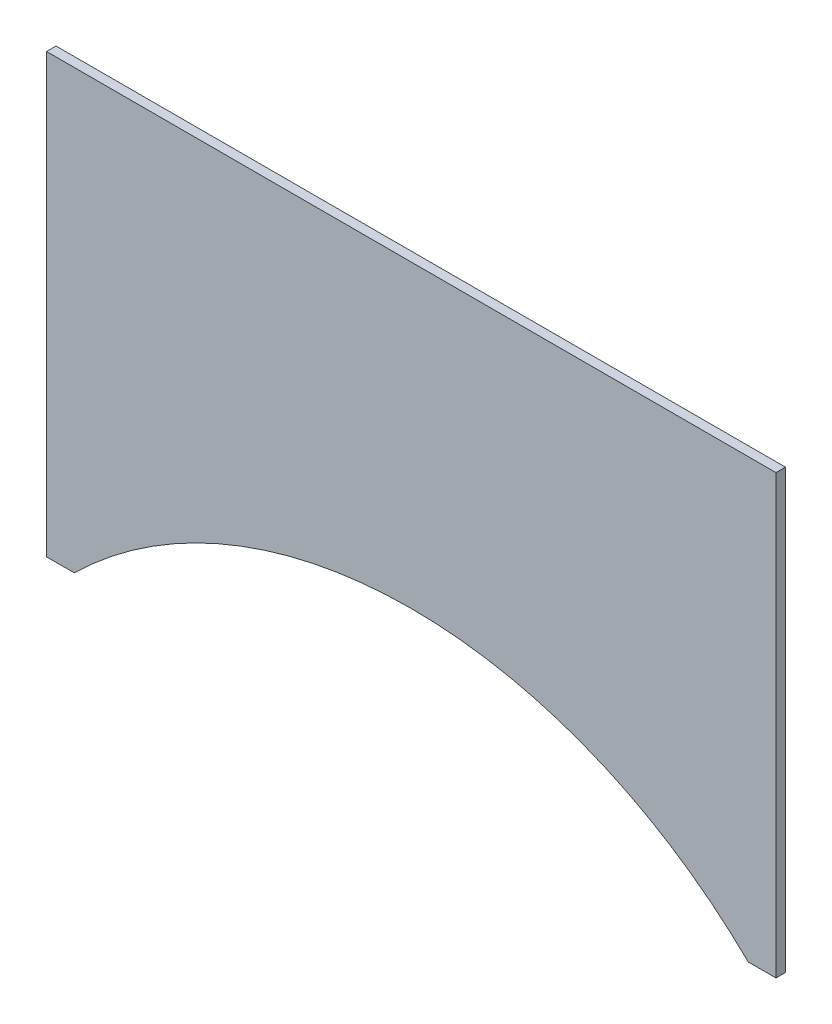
ISO-10303-21;
HEADER;
FILE_DESCRIPTION(('STEP AP214'),'2;1');
FILE_NAME('part.step','',(''),(''),'','','');
FILE_SCHEMA(('AUTOMOTIVE_DESIGN { 1 0 10303 214 1 1 1 1 }'));
ENDSEC;
DATA;
#1=APPLICATION_CONTEXT('core data for automotive mechanical design processes');
#2=APPLICATION_PROTOCOL_DEFINITION('international standard','automotive_design',2000,#1);
#3=PRODUCT_CONTEXT('',#1,'mechanical');
#4=PRODUCT('Part','Part','',(#3));
#5=PRODUCT_RELATED_PRODUCT_CATEGORY('part','',(#4));
#6=PRODUCT_DEFINITION_FORMATION('','',#4);
#7=PRODUCT_DEFINITION_CONTEXT('part definition',#1,'design');
#8=PRODUCT_DEFINITION('design','',#6,#7);
#9=PRODUCT_DEFINITION_SHAPE('','',#8);
#10=(LENGTH_UNIT() NAMED_UNIT(*) SI_UNIT(.MILLI.,.METRE.));
#11=(NAMED_UNIT(*) PLANE_ANGLE_UNIT() SI_UNIT($,.RADIAN.));
#12=(NAMED_UNIT(*) SI_UNIT($,.STERADIAN.) SOLID_ANGLE_UNIT());
#13=UNCERTAINTY_MEASURE_WITH_UNIT(LENGTH_MEASURE(1.E-05),#10,'distance_accuracy_value','');
#14=(GEOMETRIC_REPRESENTATION_CONTEXT(3) GLOBAL_UNCERTAINTY_ASSIGNED_CONTEXT((#13)) GLOBAL_UNIT_ASSIGNED_CONTEXT((#10,
#11,#12)) REPRESENTATION_CONTEXT('',''));
#15=CARTESIAN_POINT('',(0.,0.,0.));
#16=DIRECTION('',(0.,0.,1.));
#17=DIRECTION('',(1.,0.,0.));
#18=AXIS2_PLACEMENT_3D('',#15,#16,#17);
#19=CARTESIAN_POINT('',(-484.223432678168,-431.698113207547,13.));
#20=DIRECTION('',(1.,0.,0.));
#21=DIRECTION('',(0.,0.,-1.));
#22=AXIS2_PLACEMENT_3D('',#19,#20,#21);
#23=PLANE('',#22);
#24=DIRECTION('',(0.,-1.,0.));
#25=VECTOR('',#24,1.);
#26=CARTESIAN_POINT('',(-484.223432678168,-431.698113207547,0.));
#27=LINE('',#26,#25);
#28=CARTESIAN_POINT('',(-484.223432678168,168.301886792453,0.));
#29=VERTEX_POINT('',#28);
#30=CARTESIAN_POINT('',(-484.223432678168,-431.698113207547,0.));
#31=VERTEX_POINT('',#30);
#32=EDGE_CURVE('E117',#29,#31,#27,.T.);
#33=ORIENTED_EDGE('',*,*,#32,.T.);
#34=DIRECTION('',(0.,0.,-1.));
#35=VECTOR('',#34,1.);
#36=CARTESIAN_POINT('',(-484.223432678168,-431.698113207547,13.));
#37=LINE('',#36,#35);
#38=CARTESIAN_POINT('',(-484.223432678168,-431.698113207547,13.));
#39=VERTEX_POINT('',#38);
#40=EDGE_CURVE('E11',#39,#31,#37,.T.);
#41=ORIENTED_EDGE('',*,*,#40,.F.);
#42=DIRECTION('',(0.,-1.,0.));
#43=VECTOR('',#42,1.);
#44=CARTESIAN_POINT('',(-484.223432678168,-431.698113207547,13.));
#45=LINE('',#44,#43);
#46=CARTESIAN_POINT('',(-484.223432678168,168.301886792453,13.));
#47=VERTEX_POINT('',#46);
#48=EDGE_CURVE('E127',#47,#39,#45,.T.);
#49=ORIENTED_EDGE('',*,*,#48,.F.);
#50=DIRECTION('',(0.,0.,-1.));
#51=VECTOR('',#50,1.);
#52=CARTESIAN_POINT('',(-484.223432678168,168.301886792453,13.));
#53=LINE('',#52,#51);
#54=EDGE_CURVE('E113',#47,#29,#53,.T.);
#55=ORIENTED_EDGE('',*,*,#54,.T.);
#56=EDGE_LOOP('',(#33,#41,#49,#55));
#57=FACE_BOUND('',#56,.T.);
#58=ADVANCED_FACE('F33',(#57),#23,.F.);
#59=CARTESIAN_POINT('',(-484.223432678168,-431.698113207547,13.));
#60=DIRECTION('',(0.,1.,0.));
#61=DIRECTION('',(0.,0.,1.));
#62=AXIS2_PLACEMENT_3D('',#59,#60,#61);
#63=PLANE('',#62);
#64=DIRECTION('',(1.,0.,0.));
#65=VECTOR('',#64,1.);
#66=CARTESIAN_POINT('',(-484.223432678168,-431.698113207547,0.));
#67=LINE('',#66,#65);
#68=CARTESIAN_POINT('',(-446.223432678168,-431.698113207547,0.));
#69=VERTEX_POINT('',#68);
#70=EDGE_CURVE('E120',#31,#69,#67,.T.);
#71=ORIENTED_EDGE('',*,*,#70,.T.);
#72=DIRECTION('',(0.,0.,-1.));
#73=VECTOR('',#72,1.);
#74=CARTESIAN_POINT('',(-446.223432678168,-431.698113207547,13.));
#75=LINE('',#74,#73);
#76=CARTESIAN_POINT('',(-446.223432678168,-431.698113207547,13.));
#77=VERTEX_POINT('',#76);
#78=EDGE_CURVE('E41',#77,#69,#75,.T.);
#79=ORIENTED_EDGE('',*,*,#78,.F.);
#80=DIRECTION('',(1.,0.,0.));
#81=VECTOR('',#80,1.);
#82=CARTESIAN_POINT('',(-484.223432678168,-431.698113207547,13.));
#83=LINE('',#82,#81);
#84=EDGE_CURVE('E86',#39,#77,#83,.T.);
#85=ORIENTED_EDGE('',*,*,#84,.F.);
#86=ORIENTED_EDGE('',*,*,#40,.T.);
#87=EDGE_LOOP('',(#71,#79,#85,#86));
#88=FACE_BOUND('',#87,.T.);
#89=ADVANCED_FACE('F151',(#88),#63,.F.);
#90=CARTESIAN_POINT('',(15.7765673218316,-903.032389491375,13.));
#91=DIRECTION('',(0.,0.,-1.));
#92=DIRECTION('',(-1.,0.,0.));
#93=AXIS2_PLACEMENT_3D('',#90,#91,#92);
#94=CYLINDRICAL_SURFACE('',#93,660.);
#95=CARTESIAN_POINT('',(15.7765673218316,-903.032389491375,0.));
#96=DIRECTION('',(0.,0.,-1.));
#97=DIRECTION('',(-1.,0.,0.));
#98=AXIS2_PLACEMENT_3D('',#95,#96,#97);
#99=CIRCLE('',#98,660.);
#100=CARTESIAN_POINT('',(477.776567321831,-431.698113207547,0.));
#101=VERTEX_POINT('',#100);
#102=EDGE_CURVE('E122',#69,#101,#99,.T.);
#103=ORIENTED_EDGE('',*,*,#102,.T.);
#104=DIRECTION('',(0.,0.,-1.));
#105=VECTOR('',#104,1.);
#106=CARTESIAN_POINT('',(477.776567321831,-431.698113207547,13.));
#107=LINE('',#106,#105);
#108=CARTESIAN_POINT('',(477.776567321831,-431.698113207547,13.));
#109=VERTEX_POINT('',#108);
#110=EDGE_CURVE('E108',#109,#101,#107,.T.);
#111=ORIENTED_EDGE('',*,*,#110,.F.);
#112=CARTESIAN_POINT('',(15.7765673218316,-903.032389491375,13.));
#113=DIRECTION('',(0.,0.,-1.));
#114=DIRECTION('',(-1.,0.,0.));
#115=AXIS2_PLACEMENT_3D('',#112,#113,#114);
#116=CIRCLE('',#115,660.);
#117=EDGE_CURVE('E99',#77,#109,#116,.T.);
#118=ORIENTED_EDGE('',*,*,#117,.F.);
#119=ORIENTED_EDGE('',*,*,#78,.T.);
#120=EDGE_LOOP('',(#103,#111,#118,#119));
#121=FACE_BOUND('',#120,.T.);
#122=ADVANCED_FACE('F133',(#121),#94,.F.);
#123=CARTESIAN_POINT('',(515.776567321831,-431.698113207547,13.));
#124=DIRECTION('',(0.,1.,0.));
#125=DIRECTION('',(0.,0.,1.));
#126=AXIS2_PLACEMENT_3D('',#123,#124,#125);
#127=PLANE('',#126);
#128=DIRECTION('',(1.,0.,0.));
#129=VECTOR('',#128,1.);
#130=CARTESIAN_POINT('',(515.776567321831,-431.698113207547,0.));
#131=LINE('',#130,#129);
#132=CARTESIAN_POINT('',(515.776567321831,-431.698113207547,0.));
#133=VERTEX_POINT('',#132);
#134=EDGE_CURVE('E107',#101,#133,#131,.T.);
#135=ORIENTED_EDGE('',*,*,#134,.T.);
#136=DIRECTION('',(0.,0.,-1.));
#137=VECTOR('',#136,1.);
#138=CARTESIAN_POINT('',(515.776567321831,-431.698113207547,13.));
#139=LINE('',#138,#137);
#140=CARTESIAN_POINT('',(515.776567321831,-431.698113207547,13.));
#141=VERTEX_POINT('',#140);
#142=EDGE_CURVE('E104',#141,#133,#139,.T.);
#143=ORIENTED_EDGE('',*,*,#142,.F.);
#144=DIRECTION('',(1.,0.,0.));
#145=VECTOR('',#144,1.);
#146=CARTESIAN_POINT('',(515.776567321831,-431.698113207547,13.));
#147=LINE('',#146,#145);
#148=EDGE_CURVE('E93',#109,#141,#147,.T.);
#149=ORIENTED_EDGE('',*,*,#148,.F.);
#150=ORIENTED_EDGE('',*,*,#110,.T.);
#151=EDGE_LOOP('',(#135,#143,#149,#150));
#152=FACE_BOUND('',#151,.T.);
#153=ADVANCED_FACE('F105',(#152),#127,.F.);
#154=CARTESIAN_POINT('',(515.776567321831,168.301886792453,13.));
#155=DIRECTION('',(-1.,0.,0.));
#156=DIRECTION('',(0.,0.,1.));
#157=AXIS2_PLACEMENT_3D('',#154,#155,#156);
#158=PLANE('',#157);
#159=DIRECTION('',(0.,1.,0.));
#160=VECTOR('',#159,1.);
#161=CARTESIAN_POINT('',(515.776567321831,168.301886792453,0.));
#162=LINE('',#161,#160);
#163=CARTESIAN_POINT('',(515.776567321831,168.301886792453,0.));
#164=VERTEX_POINT('',#163);
#165=EDGE_CURVE('E72',#133,#164,#162,.T.);
#166=ORIENTED_EDGE('',*,*,#165,.T.);
#167=DIRECTION('',(0.,0.,-1.));
#168=VECTOR('',#167,1.);
#169=CARTESIAN_POINT('',(515.776567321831,168.301886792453,13.));
#170=LINE('',#169,#168);
#171=CARTESIAN_POINT('',(515.776567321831,168.301886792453,13.));
#172=VERTEX_POINT('',#171);
#173=EDGE_CURVE('E109',#172,#164,#170,.T.);
#174=ORIENTED_EDGE('',*,*,#173,.F.);
#175=DIRECTION('',(0.,1.,0.));
#176=VECTOR('',#175,1.);
#177=CARTESIAN_POINT('',(515.776567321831,168.301886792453,13.));
#178=LINE('',#177,#176);
#179=EDGE_CURVE('E97',#141,#172,#178,.T.);
#180=ORIENTED_EDGE('',*,*,#179,.F.);
#181=ORIENTED_EDGE('',*,*,#142,.T.);
#182=EDGE_LOOP('',(#166,#174,#180,#181));
#183=FACE_BOUND('',#182,.T.);
#184=ADVANCED_FACE('F111',(#183),#158,.F.);
#185=CARTESIAN_POINT('',(-484.223432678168,168.301886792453,13.));
#186=DIRECTION('',(0.,-1.,0.));
#187=DIRECTION('',(0.,0.,-1.));
#188=AXIS2_PLACEMENT_3D('',#185,#186,#187);
#189=PLANE('',#188);
#190=DIRECTION('',(-1.,0.,0.));
#191=VECTOR('',#190,1.);
#192=CARTESIAN_POINT('',(-484.223432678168,168.301886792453,0.));
#193=LINE('',#192,#191);
#194=EDGE_CURVE('E78',#164,#29,#193,.T.);
#195=ORIENTED_EDGE('',*,*,#194,.T.);
#196=ORIENTED_EDGE('',*,*,#54,.F.);
#197=DIRECTION('',(-1.,0.,0.));
#198=VECTOR('',#197,1.);
#199=CARTESIAN_POINT('',(-484.223432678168,168.301886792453,13.));
#200=LINE('',#199,#198);
#201=EDGE_CURVE('E49',#172,#47,#200,.T.);
#202=ORIENTED_EDGE('',*,*,#201,.F.);
#203=ORIENTED_EDGE('',*,*,#173,.T.);
#204=EDGE_LOOP('',(#195,#196,#202,#203));
#205=FACE_BOUND('',#204,.T.);
#206=ADVANCED_FACE('F140',(#205),#189,.F.);
#207=CARTESIAN_POINT('',(15.7765673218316,-903.032389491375,13.));
#208=DIRECTION('',(0.,0.,-1.));
#209=DIRECTION('',(-1.,0.,0.));
#210=AXIS2_PLACEMENT_3D('',#207,#208,#209);
#211=PLANE('',#210);
#212=ORIENTED_EDGE('',*,*,#48,.T.);
#213=ORIENTED_EDGE('',*,*,#84,.T.);
#214=ORIENTED_EDGE('',*,*,#117,.T.);
#215=ORIENTED_EDGE('',*,*,#148,.T.);
#216=ORIENTED_EDGE('',*,*,#179,.T.);
#217=ORIENTED_EDGE('',*,*,#201,.T.);
#218=EDGE_LOOP('',(#212,#213,#214,#215,#216,#217));
#219=FACE_BOUND('',#218,.T.);
#220=ADVANCED_FACE('F95',(#219),#211,.F.);
#221=CARTESIAN_POINT('',(15.7765673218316,-903.032389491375,0.));
#222=DIRECTION('',(0.,0.,-1.));
#223=DIRECTION('',(-1.,0.,0.));
#224=AXIS2_PLACEMENT_3D('',#221,#222,#223);
#225=PLANE('',#224);
#226=ORIENTED_EDGE('',*,*,#32,.F.);
#227=ORIENTED_EDGE('',*,*,#194,.F.);
#228=ORIENTED_EDGE('',*,*,#165,.F.);
#229=ORIENTED_EDGE('',*,*,#134,.F.);
#230=ORIENTED_EDGE('',*,*,#102,.F.);
#231=ORIENTED_EDGE('',*,*,#70,.F.);
#232=EDGE_LOOP('',(#226,#227,#228,#229,#230,#231));
#233=FACE_BOUND('',#232,.T.);
#234=ADVANCED_FACE('F136',(#233),#225,.T.);
#235=CLOSED_SHELL('',(#58,#89,#122,#153,#184,#206,#220,#234));
#236=MANIFOLD_SOLID_BREP('B2',#235);
#237=ADVANCED_BREP_SHAPE_REPRESENTATION('',(#18,#236),#14);
#238=SHAPE_DEFINITION_REPRESENTATION(#9,#237);
ENDSEC;
END-ISO-10303-21;
